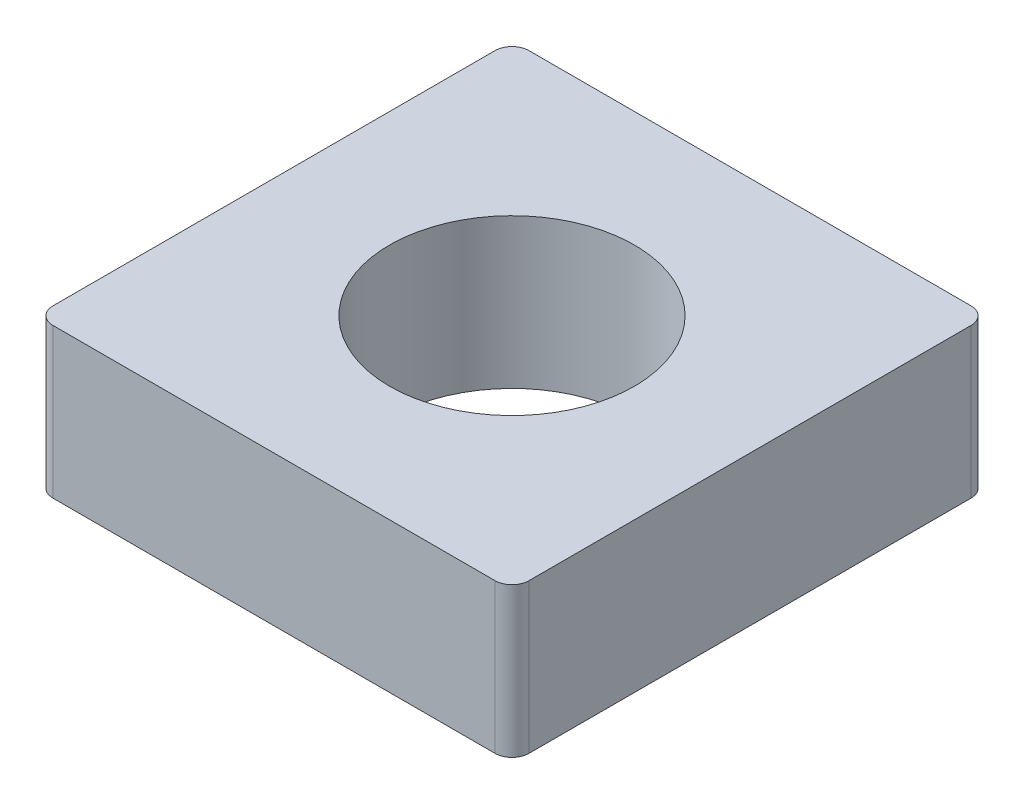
ISO-10303-21;
HEADER;
FILE_DESCRIPTION(('STEP AP214'),'2;1');
FILE_NAME('part.step','',(''),(''),'','','');
FILE_SCHEMA(('AUTOMOTIVE_DESIGN { 1 0 10303 214 1 1 1 1 }'));
ENDSEC;
DATA;
#1=APPLICATION_CONTEXT('core data for automotive mechanical design processes');
#2=APPLICATION_PROTOCOL_DEFINITION('international standard','automotive_design',2000,#1);
#3=PRODUCT_CONTEXT('',#1,'mechanical');
#4=PRODUCT('Part','Part','',(#3));
#5=PRODUCT_RELATED_PRODUCT_CATEGORY('part','',(#4));
#6=PRODUCT_DEFINITION_FORMATION('','',#4);
#7=PRODUCT_DEFINITION_CONTEXT('part definition',#1,'design');
#8=PRODUCT_DEFINITION('design','',#6,#7);
#9=PRODUCT_DEFINITION_SHAPE('','',#8);
#10=(LENGTH_UNIT() NAMED_UNIT(*) SI_UNIT(.MILLI.,.METRE.));
#11=(NAMED_UNIT(*) PLANE_ANGLE_UNIT() SI_UNIT($,.RADIAN.));
#12=(NAMED_UNIT(*) SI_UNIT($,.STERADIAN.) SOLID_ANGLE_UNIT());
#13=UNCERTAINTY_MEASURE_WITH_UNIT(LENGTH_MEASURE(1.E-05),#10,'distance_accuracy_value','');
#14=(GEOMETRIC_REPRESENTATION_CONTEXT(3) GLOBAL_UNCERTAINTY_ASSIGNED_CONTEXT((#13)) GLOBAL_UNIT_ASSIGNED_CONTEXT((#10,
#11,#12)) REPRESENTATION_CONTEXT('',''));
#15=CARTESIAN_POINT('',(0.,0.,0.));
#16=DIRECTION('',(0.,0.,1.));
#17=DIRECTION('',(1.,0.,0.));
#18=AXIS2_PLACEMENT_3D('',#15,#16,#17);
#19=CARTESIAN_POINT('',(0.,2.2,0.));
#20=DIRECTION('',(0.,1.,0.));
#21=DIRECTION('',(0.,0.,1.));
#22=AXIS2_PLACEMENT_3D('',#19,#20,#21);
#23=PLANE('',#22);
#24=DIRECTION('',(-1.,0.,0.));
#25=VECTOR('',#24,1.);
#26=CARTESIAN_POINT('',(3.5,2.2,-3.5));
#27=LINE('',#26,#25);
#28=CARTESIAN_POINT('',(3.25,2.2,-3.5));
#29=VERTEX_POINT('',#28);
#30=CARTESIAN_POINT('',(-3.25,2.2,-3.5));
#31=VERTEX_POINT('',#30);
#32=EDGE_CURVE('E141',#29,#31,#27,.T.);
#33=ORIENTED_EDGE('',*,*,#32,.T.);
#34=CARTESIAN_POINT('',(-3.25,2.2,-3.25));
#35=DIRECTION('',(0.,1.,0.));
#36=DIRECTION('',(0.,0.,1.));
#37=AXIS2_PLACEMENT_3D('',#34,#35,#36);
#38=CIRCLE('',#37,0.25);
#39=CARTESIAN_POINT('',(-3.5,2.2,-3.25));
#40=VERTEX_POINT('',#39);
#41=EDGE_CURVE('E159',#31,#40,#38,.T.);
#42=ORIENTED_EDGE('',*,*,#41,.T.);
#43=DIRECTION('',(0.,0.,1.));
#44=VECTOR('',#43,1.);
#45=CARTESIAN_POINT('',(-3.5,2.2,3.5));
#46=LINE('',#45,#44);
#47=CARTESIAN_POINT('',(-3.5,2.2,3.25));
#48=VERTEX_POINT('',#47);
#49=EDGE_CURVE('E123',#40,#48,#46,.T.);
#50=ORIENTED_EDGE('',*,*,#49,.T.);
#51=CARTESIAN_POINT('',(-3.25,2.2,3.25));
#52=DIRECTION('',(0.,1.,0.));
#53=DIRECTION('',(0.,0.,1.));
#54=AXIS2_PLACEMENT_3D('',#51,#52,#53);
#55=CIRCLE('',#54,0.25);
#56=CARTESIAN_POINT('',(-3.25,2.2,3.5));
#57=VERTEX_POINT('',#56);
#58=EDGE_CURVE('E155',#48,#57,#55,.T.);
#59=ORIENTED_EDGE('',*,*,#58,.T.);
#60=DIRECTION('',(1.,0.,0.));
#61=VECTOR('',#60,1.);
#62=CARTESIAN_POINT('',(3.5,2.2,3.5));
#63=LINE('',#62,#61);
#64=CARTESIAN_POINT('',(3.25,2.2,3.5));
#65=VERTEX_POINT('',#64);
#66=EDGE_CURVE('E168',#57,#65,#63,.T.);
#67=ORIENTED_EDGE('',*,*,#66,.T.);
#68=CARTESIAN_POINT('',(3.25,2.2,3.25));
#69=DIRECTION('',(0.,1.,0.));
#70=DIRECTION('',(0.,0.,1.));
#71=AXIS2_PLACEMENT_3D('',#68,#69,#70);
#72=CIRCLE('',#71,0.25);
#73=CARTESIAN_POINT('',(3.5,2.2,3.25));
#74=VERTEX_POINT('',#73);
#75=EDGE_CURVE('E58',#65,#74,#72,.T.);
#76=ORIENTED_EDGE('',*,*,#75,.T.);
#77=DIRECTION('',(0.,0.,-1.));
#78=VECTOR('',#77,1.);
#79=CARTESIAN_POINT('',(3.5,2.2,3.5));
#80=LINE('',#79,#78);
#81=CARTESIAN_POINT('',(3.5,2.2,-3.25));
#82=VERTEX_POINT('',#81);
#83=EDGE_CURVE('E174',#74,#82,#80,.T.);
#84=ORIENTED_EDGE('',*,*,#83,.T.);
#85=CARTESIAN_POINT('',(3.25,2.2,-3.25));
#86=DIRECTION('',(0.,1.,0.));
#87=DIRECTION('',(0.,0.,1.));
#88=AXIS2_PLACEMENT_3D('',#85,#86,#87);
#89=CIRCLE('',#88,0.25);
#90=EDGE_CURVE('E157',#82,#29,#89,.T.);
#91=ORIENTED_EDGE('',*,*,#90,.T.);
#92=EDGE_LOOP('',(#33,#42,#50,#59,#67,#76,#84,#91));
#93=FACE_BOUND('',#92,.T.);
#94=CARTESIAN_POINT('',(0.,2.2,0.));
#95=DIRECTION('',(0.,1.,0.));
#96=DIRECTION('',(0.,0.,1.));
#97=AXIS2_PLACEMENT_3D('',#94,#95,#96);
#98=CIRCLE('',#97,1.8);
#99=CARTESIAN_POINT('',(0.,2.2,1.8));
#100=VERTEX_POINT('',#99);
#101=EDGE_CURVE('E132',#100,#100,#98,.T.);
#102=ORIENTED_EDGE('',*,*,#101,.F.);
#103=EDGE_LOOP('',(#102));
#104=FACE_BOUND('',#103,.T.);
#105=ADVANCED_FACE('F36',(#93,#104),#23,.T.);
#106=CARTESIAN_POINT('',(0.,0.,0.));
#107=DIRECTION('',(0.,1.,0.));
#108=DIRECTION('',(0.,0.,1.));
#109=AXIS2_PLACEMENT_3D('',#106,#107,#108);
#110=PLANE('',#109);
#111=DIRECTION('',(0.,0.,1.));
#112=VECTOR('',#111,1.);
#113=CARTESIAN_POINT('',(-3.5,0.,3.5));
#114=LINE('',#113,#112);
#115=CARTESIAN_POINT('',(-3.5,0.,-3.25));
#116=VERTEX_POINT('',#115);
#117=CARTESIAN_POINT('',(-3.5,0.,3.25));
#118=VERTEX_POINT('',#117);
#119=EDGE_CURVE('E120',#116,#118,#114,.T.);
#120=ORIENTED_EDGE('',*,*,#119,.F.);
#121=CARTESIAN_POINT('',(-3.25,0.,-3.25));
#122=DIRECTION('',(0.,1.,0.));
#123=DIRECTION('',(0.,0.,1.));
#124=AXIS2_PLACEMENT_3D('',#121,#122,#123);
#125=CIRCLE('',#124,0.25);
#126=CARTESIAN_POINT('',(-3.25,0.,-3.5));
#127=VERTEX_POINT('',#126);
#128=EDGE_CURVE('E103',#116,#127,#125,.F.);
#129=ORIENTED_EDGE('',*,*,#128,.T.);
#130=DIRECTION('',(-1.,0.,0.));
#131=VECTOR('',#130,1.);
#132=CARTESIAN_POINT('',(3.5,0.,-3.5));
#133=LINE('',#132,#131);
#134=CARTESIAN_POINT('',(3.25,0.,-3.5));
#135=VERTEX_POINT('',#134);
#136=EDGE_CURVE('E145',#135,#127,#133,.T.);
#137=ORIENTED_EDGE('',*,*,#136,.F.);
#138=CARTESIAN_POINT('',(3.25,0.,-3.25));
#139=DIRECTION('',(0.,1.,0.));
#140=DIRECTION('',(0.,0.,1.));
#141=AXIS2_PLACEMENT_3D('',#138,#139,#140);
#142=CIRCLE('',#141,0.25);
#143=CARTESIAN_POINT('',(3.5,0.,-3.25));
#144=VERTEX_POINT('',#143);
#145=EDGE_CURVE('E114',#135,#144,#142,.F.);
#146=ORIENTED_EDGE('',*,*,#145,.T.);
#147=DIRECTION('',(0.,0.,-1.));
#148=VECTOR('',#147,1.);
#149=CARTESIAN_POINT('',(3.5,0.,3.5));
#150=LINE('',#149,#148);
#151=CARTESIAN_POINT('',(3.5,0.,3.25));
#152=VERTEX_POINT('',#151);
#153=EDGE_CURVE('E135',#152,#144,#150,.T.);
#154=ORIENTED_EDGE('',*,*,#153,.F.);
#155=CARTESIAN_POINT('',(3.25,0.,3.25));
#156=DIRECTION('',(0.,1.,0.));
#157=DIRECTION('',(0.,0.,1.));
#158=AXIS2_PLACEMENT_3D('',#155,#156,#157);
#159=CIRCLE('',#158,0.25);
#160=CARTESIAN_POINT('',(3.25,0.,3.5));
#161=VERTEX_POINT('',#160);
#162=EDGE_CURVE('E124',#152,#161,#159,.F.);
#163=ORIENTED_EDGE('',*,*,#162,.T.);
#164=DIRECTION('',(1.,0.,0.));
#165=VECTOR('',#164,1.);
#166=CARTESIAN_POINT('',(3.5,0.,3.5));
#167=LINE('',#166,#165);
#168=CARTESIAN_POINT('',(-3.25,0.,3.5));
#169=VERTEX_POINT('',#168);
#170=EDGE_CURVE('E131',#169,#161,#167,.T.);
#171=ORIENTED_EDGE('',*,*,#170,.F.);
#172=CARTESIAN_POINT('',(-3.25,0.,3.25));
#173=DIRECTION('',(0.,1.,0.));
#174=DIRECTION('',(0.,0.,1.));
#175=AXIS2_PLACEMENT_3D('',#172,#173,#174);
#176=CIRCLE('',#175,0.25);
#177=EDGE_CURVE('E130',#169,#118,#176,.F.);
#178=ORIENTED_EDGE('',*,*,#177,.T.);
#179=EDGE_LOOP('',(#120,#129,#137,#146,#154,#163,#171,#178));
#180=FACE_BOUND('',#179,.T.);
#181=CARTESIAN_POINT('',(0.,0.,0.));
#182=DIRECTION('',(0.,1.,0.));
#183=DIRECTION('',(0.,0.,1.));
#184=AXIS2_PLACEMENT_3D('',#181,#182,#183);
#185=CIRCLE('',#184,1.8);
#186=CARTESIAN_POINT('',(0.,0.,1.8));
#187=VERTEX_POINT('',#186);
#188=EDGE_CURVE('E138',#187,#187,#185,.T.);
#189=ORIENTED_EDGE('',*,*,#188,.T.);
#190=EDGE_LOOP('',(#189));
#191=FACE_BOUND('',#190,.T.);
#192=ADVANCED_FACE('F127',(#180,#191),#110,.F.);
#193=CARTESIAN_POINT('',(-3.5,2.2,3.5));
#194=DIRECTION('',(1.,0.,0.));
#195=DIRECTION('',(0.,0.,-1.));
#196=AXIS2_PLACEMENT_3D('',#193,#194,#195);
#197=PLANE('',#196);
#198=ORIENTED_EDGE('',*,*,#49,.F.);
#199=DIRECTION('',(0.,-1.,0.));
#200=VECTOR('',#199,1.);
#201=CARTESIAN_POINT('',(-3.5,2.2,-3.25));
#202=LINE('',#201,#200);
#203=EDGE_CURVE('E107',#40,#116,#202,.T.);
#204=ORIENTED_EDGE('',*,*,#203,.T.);
#205=ORIENTED_EDGE('',*,*,#119,.T.);
#206=DIRECTION('',(0.,-1.,0.));
#207=VECTOR('',#206,1.);
#208=CARTESIAN_POINT('',(-3.5,2.2,3.25));
#209=LINE('',#208,#207);
#210=EDGE_CURVE('E125',#118,#48,#209,.F.);
#211=ORIENTED_EDGE('',*,*,#210,.T.);
#212=EDGE_LOOP('',(#198,#204,#205,#211));
#213=FACE_BOUND('',#212,.T.);
#214=ADVANCED_FACE('F119',(#213),#197,.F.);
#215=CARTESIAN_POINT('',(3.5,2.2,3.5));
#216=DIRECTION('',(0.,0.,-1.));
#217=DIRECTION('',(-1.,0.,0.));
#218=AXIS2_PLACEMENT_3D('',#215,#216,#217);
#219=PLANE('',#218);
#220=ORIENTED_EDGE('',*,*,#66,.F.);
#221=DIRECTION('',(0.,-1.,0.));
#222=VECTOR('',#221,1.);
#223=CARTESIAN_POINT('',(-3.25,2.2,3.5));
#224=LINE('',#223,#222);
#225=EDGE_CURVE('E11',#57,#169,#224,.T.);
#226=ORIENTED_EDGE('',*,*,#225,.T.);
#227=ORIENTED_EDGE('',*,*,#170,.T.);
#228=DIRECTION('',(0.,-1.,0.));
#229=VECTOR('',#228,1.);
#230=CARTESIAN_POINT('',(3.25,2.2,3.5));
#231=LINE('',#230,#229);
#232=EDGE_CURVE('E44',#161,#65,#231,.F.);
#233=ORIENTED_EDGE('',*,*,#232,.T.);
#234=EDGE_LOOP('',(#220,#226,#227,#233));
#235=FACE_BOUND('',#234,.T.);
#236=ADVANCED_FACE('F167',(#235),#219,.F.);
#237=CARTESIAN_POINT('',(3.5,2.2,3.5));
#238=DIRECTION('',(-1.,0.,0.));
#239=DIRECTION('',(0.,0.,1.));
#240=AXIS2_PLACEMENT_3D('',#237,#238,#239);
#241=PLANE('',#240);
#242=ORIENTED_EDGE('',*,*,#153,.T.);
#243=DIRECTION('',(0.,-1.,0.));
#244=VECTOR('',#243,1.);
#245=CARTESIAN_POINT('',(3.5,2.2,-3.25));
#246=LINE('',#245,#244);
#247=EDGE_CURVE('E51',#144,#82,#246,.F.);
#248=ORIENTED_EDGE('',*,*,#247,.T.);
#249=ORIENTED_EDGE('',*,*,#83,.F.);
#250=DIRECTION('',(0.,-1.,0.));
#251=VECTOR('',#250,1.);
#252=CARTESIAN_POINT('',(3.5,2.2,3.25));
#253=LINE('',#252,#251);
#254=EDGE_CURVE('E161',#74,#152,#253,.T.);
#255=ORIENTED_EDGE('',*,*,#254,.T.);
#256=EDGE_LOOP('',(#242,#248,#249,#255));
#257=FACE_BOUND('',#256,.T.);
#258=ADVANCED_FACE('F178',(#257),#241,.F.);
#259=CARTESIAN_POINT('',(3.5,2.2,-3.5));
#260=DIRECTION('',(0.,0.,1.));
#261=DIRECTION('',(1.,0.,0.));
#262=AXIS2_PLACEMENT_3D('',#259,#260,#261);
#263=PLANE('',#262);
#264=ORIENTED_EDGE('',*,*,#136,.T.);
#265=DIRECTION('',(0.,-1.,0.));
#266=VECTOR('',#265,1.);
#267=CARTESIAN_POINT('',(-3.25,2.2,-3.5));
#268=LINE('',#267,#266);
#269=EDGE_CURVE('E108',#127,#31,#268,.F.);
#270=ORIENTED_EDGE('',*,*,#269,.T.);
#271=ORIENTED_EDGE('',*,*,#32,.F.);
#272=DIRECTION('',(0.,-1.,0.));
#273=VECTOR('',#272,1.);
#274=CARTESIAN_POINT('',(3.25,2.2,-3.5));
#275=LINE('',#274,#273);
#276=EDGE_CURVE('E113',#29,#135,#275,.T.);
#277=ORIENTED_EDGE('',*,*,#276,.T.);
#278=EDGE_LOOP('',(#264,#270,#271,#277));
#279=FACE_BOUND('',#278,.T.);
#280=ADVANCED_FACE('F185',(#279),#263,.F.);
#281=CARTESIAN_POINT('',(0.,2.2,0.));
#282=DIRECTION('',(0.,-1.,0.));
#283=DIRECTION('',(0.,0.,-1.));
#284=AXIS2_PLACEMENT_3D('',#281,#282,#283);
#285=CYLINDRICAL_SURFACE('',#284,1.8);
#286=ORIENTED_EDGE('',*,*,#101,.T.);
#287=EDGE_LOOP('',(#286));
#288=FACE_BOUND('',#287,.T.);
#289=ORIENTED_EDGE('',*,*,#188,.F.);
#290=EDGE_LOOP('',(#289));
#291=FACE_BOUND('',#290,.T.);
#292=ADVANCED_FACE('F191',(#288,#291),#285,.F.);
#293=CARTESIAN_POINT('',(-3.25,2.2,-3.25));
#294=DIRECTION('',(0.,-1.,0.));
#295=DIRECTION('',(0.,0.,-1.));
#296=AXIS2_PLACEMENT_3D('',#293,#294,#295);
#297=CYLINDRICAL_SURFACE('',#296,0.25);
#298=ORIENTED_EDGE('',*,*,#41,.F.);
#299=ORIENTED_EDGE('',*,*,#269,.F.);
#300=ORIENTED_EDGE('',*,*,#128,.F.);
#301=ORIENTED_EDGE('',*,*,#203,.F.);
#302=EDGE_LOOP('',(#298,#299,#300,#301));
#303=FACE_BOUND('',#302,.T.);
#304=ADVANCED_FACE('F106',(#303),#297,.T.);
#305=CARTESIAN_POINT('',(3.25,2.2,-3.25));
#306=DIRECTION('',(0.,-1.,0.));
#307=DIRECTION('',(0.,0.,-1.));
#308=AXIS2_PLACEMENT_3D('',#305,#306,#307);
#309=CYLINDRICAL_SURFACE('',#308,0.25);
#310=ORIENTED_EDGE('',*,*,#90,.F.);
#311=ORIENTED_EDGE('',*,*,#247,.F.);
#312=ORIENTED_EDGE('',*,*,#145,.F.);
#313=ORIENTED_EDGE('',*,*,#276,.F.);
#314=EDGE_LOOP('',(#310,#311,#312,#313));
#315=FACE_BOUND('',#314,.T.);
#316=ADVANCED_FACE('F182',(#315),#309,.T.);
#317=CARTESIAN_POINT('',(-3.25,2.2,3.25));
#318=DIRECTION('',(0.,-1.,0.));
#319=DIRECTION('',(0.,0.,-1.));
#320=AXIS2_PLACEMENT_3D('',#317,#318,#319);
#321=CYLINDRICAL_SURFACE('',#320,0.25);
#322=ORIENTED_EDGE('',*,*,#58,.F.);
#323=ORIENTED_EDGE('',*,*,#210,.F.);
#324=ORIENTED_EDGE('',*,*,#177,.F.);
#325=ORIENTED_EDGE('',*,*,#225,.F.);
#326=EDGE_LOOP('',(#322,#323,#324,#325));
#327=FACE_BOUND('',#326,.T.);
#328=ADVANCED_FACE('F215',(#327),#321,.T.);
#329=CARTESIAN_POINT('',(3.25,2.2,3.25));
#330=DIRECTION('',(0.,-1.,0.));
#331=DIRECTION('',(0.,0.,-1.));
#332=AXIS2_PLACEMENT_3D('',#329,#330,#331);
#333=CYLINDRICAL_SURFACE('',#332,0.25);
#334=ORIENTED_EDGE('',*,*,#75,.F.);
#335=ORIENTED_EDGE('',*,*,#232,.F.);
#336=ORIENTED_EDGE('',*,*,#162,.F.);
#337=ORIENTED_EDGE('',*,*,#254,.F.);
#338=EDGE_LOOP('',(#334,#335,#336,#337));
#339=FACE_BOUND('',#338,.T.);
#340=ADVANCED_FACE('F38',(#339),#333,.T.);
#341=CLOSED_SHELL('',(#105,#192,#214,#236,#258,#280,#292,#304,#316,#328,#340));
#342=MANIFOLD_SOLID_BREP('B2',#341);
#343=ADVANCED_BREP_SHAPE_REPRESENTATION('',(#18,#342),#14);
#344=SHAPE_DEFINITION_REPRESENTATION(#9,#343);
ENDSEC;
END-ISO-10303-21;
